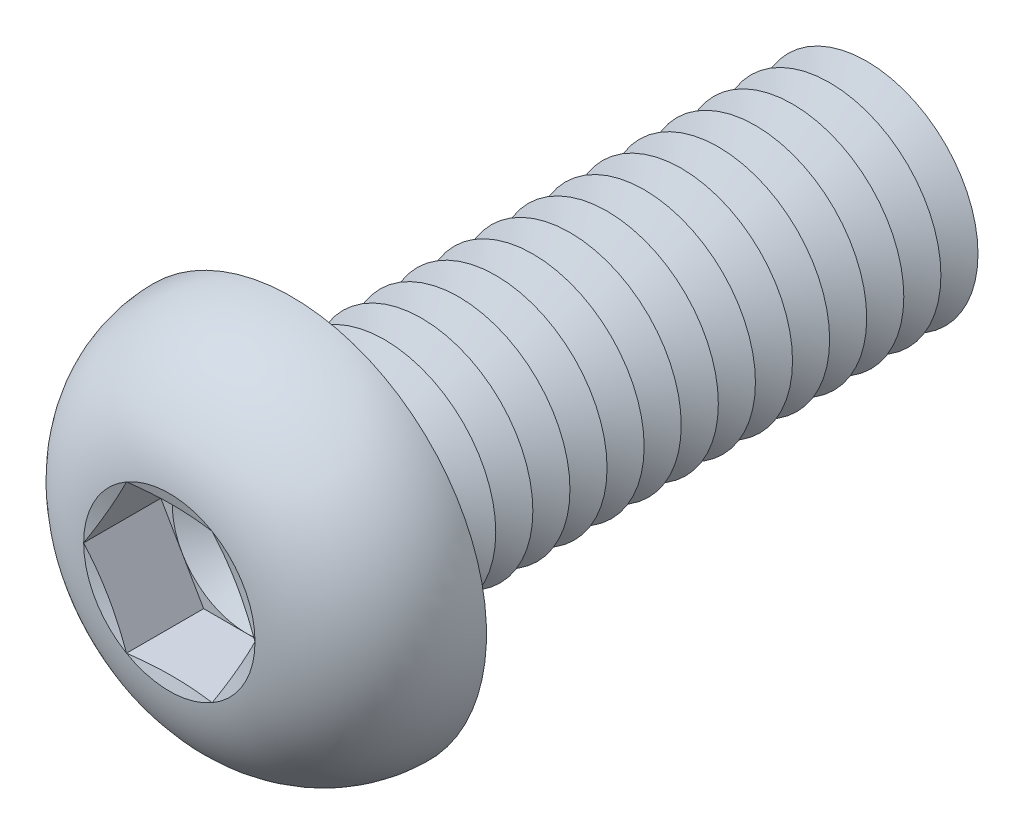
ISO-10303-21;
HEADER;
FILE_DESCRIPTION(('STEP AP214'),'2;1');
FILE_NAME('part.step','',(''),(''),'','','');
FILE_SCHEMA(('AUTOMOTIVE_DESIGN { 1 0 10303 214 1 1 1 1 }'));
ENDSEC;
DATA;
#1=APPLICATION_CONTEXT('core data for automotive mechanical design processes');
#2=APPLICATION_PROTOCOL_DEFINITION('international standard','automotive_design',2000,#1);
#3=PRODUCT_CONTEXT('',#1,'mechanical');
#4=PRODUCT('Part','Part','',(#3));
#5=PRODUCT_RELATED_PRODUCT_CATEGORY('part','',(#4));
#6=PRODUCT_DEFINITION_FORMATION('','',#4);
#7=PRODUCT_DEFINITION_CONTEXT('part definition',#1,'design');
#8=PRODUCT_DEFINITION('design','',#6,#7);
#9=PRODUCT_DEFINITION_SHAPE('','',#8);
#10=(LENGTH_UNIT() NAMED_UNIT(*) SI_UNIT(.MILLI.,.METRE.));
#11=(NAMED_UNIT(*) PLANE_ANGLE_UNIT() SI_UNIT($,.RADIAN.));
#12=(NAMED_UNIT(*) SI_UNIT($,.STERADIAN.) SOLID_ANGLE_UNIT());
#13=UNCERTAINTY_MEASURE_WITH_UNIT(LENGTH_MEASURE(1.E-05),#10,'distance_accuracy_value','');
#14=(GEOMETRIC_REPRESENTATION_CONTEXT(3) GLOBAL_UNCERTAINTY_ASSIGNED_CONTEXT((#13)) GLOBAL_UNIT_ASSIGNED_CONTEXT((#10,
#11,#12)) REPRESENTATION_CONTEXT('',''));
#15=CARTESIAN_POINT('',(0.,0.,0.));
#16=DIRECTION('',(0.,0.,1.));
#17=DIRECTION('',(1.,0.,0.));
#18=AXIS2_PLACEMENT_3D('',#15,#16,#17);
#19=CARTESIAN_POINT('',(0.,0.,1.22));
#20=DIRECTION('',(0.,0.,1.));
#21=DIRECTION('',(1.,0.,0.));
#22=AXIS2_PLACEMENT_3D('',#19,#20,#21);
#23=PLANE('',#22);
#24=CARTESIAN_POINT('',(0.,0.,1.22));
#25=DIRECTION('',(0.,0.,1.));
#26=DIRECTION('',(1.,0.,0.));
#27=AXIS2_PLACEMENT_3D('',#24,#25,#26);
#28=CIRCLE('',#27,1.99999906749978);
#29=CARTESIAN_POINT('',(1.73205,0.999999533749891,1.22));
#30=VERTEX_POINT('',#29);
#31=CARTESIAN_POINT('',(0.,1.99999906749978,1.22));
#32=VERTEX_POINT('',#31);
#33=EDGE_CURVE('E118',#30,#32,#28,.T.);
#34=ORIENTED_EDGE('',*,*,#33,.F.);
#35=DIRECTION('',(-0.5,0.866025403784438,0.));
#36=VECTOR('',#35,1.);
#37=CARTESIAN_POINT('',(2.3094,0.,1.22));
#38=LINE('',#37,#36);
#39=CARTESIAN_POINT('',(1.1547,1.99999906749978,1.22));
#40=VERTEX_POINT('',#39);
#41=EDGE_CURVE('E125',#30,#40,#38,.T.);
#42=ORIENTED_EDGE('',*,*,#41,.T.);
#43=DIRECTION('',(-1.,0.,0.));
#44=VECTOR('',#43,1.);
#45=CARTESIAN_POINT('',(1.1547,1.99999906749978,1.22));
#46=LINE('',#45,#44);
#47=EDGE_CURVE('E136',#40,#32,#46,.T.);
#48=ORIENTED_EDGE('',*,*,#47,.T.);
#49=EDGE_LOOP('',(#34,#42,#48));
#50=FACE_BOUND('',#49,.T.);
#51=ADVANCED_FACE('F39',(#50),#23,.T.);
#52=CARTESIAN_POINT('',(0.,0.,1.22));
#53=DIRECTION('',(0.,0.,1.));
#54=DIRECTION('',(1.,0.,0.));
#55=AXIS2_PLACEMENT_3D('',#52,#53,#54);
#56=CIRCLE('',#55,1.99999906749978);
#57=CARTESIAN_POINT('',(-1.73205,0.999999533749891,1.22));
#58=VERTEX_POINT('',#57);
#59=EDGE_CURVE('E11',#32,#58,#56,.T.);
#60=ORIENTED_EDGE('',*,*,#59,.F.);
#61=CARTESIAN_POINT('',(-1.1547,1.99999906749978,1.22));
#62=VERTEX_POINT('',#61);
#63=EDGE_CURVE('E131',#32,#62,#46,.T.);
#64=ORIENTED_EDGE('',*,*,#63,.T.);
#65=DIRECTION('',(-0.5,-0.866025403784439,0.));
#66=VECTOR('',#65,1.);
#67=CARTESIAN_POINT('',(-1.1547,1.99999906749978,1.22));
#68=LINE('',#67,#66);
#69=EDGE_CURVE('E134',#62,#58,#68,.T.);
#70=ORIENTED_EDGE('',*,*,#69,.T.);
#71=EDGE_LOOP('',(#60,#64,#70));
#72=FACE_BOUND('',#71,.T.);
#73=ADVANCED_FACE('F130',(#72),#23,.T.);
#74=CARTESIAN_POINT('',(-1.73205,-0.999999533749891,1.22));
#75=VERTEX_POINT('',#74);
#76=EDGE_CURVE('E49',#58,#75,#56,.T.);
#77=ORIENTED_EDGE('',*,*,#76,.F.);
#78=CARTESIAN_POINT('',(-2.3094,0.,1.22));
#79=VERTEX_POINT('',#78);
#80=EDGE_CURVE('E143',#58,#79,#68,.T.);
#81=ORIENTED_EDGE('',*,*,#80,.T.);
#82=DIRECTION('',(0.5,-0.866025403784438,0.));
#83=VECTOR('',#82,1.);
#84=CARTESIAN_POINT('',(-2.3094,0.,1.22));
#85=LINE('',#84,#83);
#86=EDGE_CURVE('E152',#79,#75,#85,.T.);
#87=ORIENTED_EDGE('',*,*,#86,.T.);
#88=EDGE_LOOP('',(#77,#81,#87));
#89=FACE_BOUND('',#88,.T.);
#90=ADVANCED_FACE('F394',(#89),#23,.T.);
#91=CARTESIAN_POINT('',(0.,-1.99999906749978,1.22));
#92=VERTEX_POINT('',#91);
#93=EDGE_CURVE('E378',#75,#92,#56,.T.);
#94=ORIENTED_EDGE('',*,*,#93,.F.);
#95=CARTESIAN_POINT('',(-1.1547,-1.99999906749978,1.22));
#96=VERTEX_POINT('',#95);
#97=EDGE_CURVE('E151',#75,#96,#85,.T.);
#98=ORIENTED_EDGE('',*,*,#97,.T.);
#99=DIRECTION('',(1.,0.,0.));
#100=VECTOR('',#99,1.);
#101=CARTESIAN_POINT('',(-1.1547,-1.99999906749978,1.22));
#102=LINE('',#101,#100);
#103=EDGE_CURVE('E157',#96,#92,#102,.T.);
#104=ORIENTED_EDGE('',*,*,#103,.T.);
#105=EDGE_LOOP('',(#94,#98,#104));
#106=FACE_BOUND('',#105,.T.);
#107=ADVANCED_FACE('F387',(#106),#23,.T.);
#108=CARTESIAN_POINT('',(1.73205,-0.999999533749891,1.22));
#109=VERTEX_POINT('',#108);
#110=EDGE_CURVE('E56',#92,#109,#56,.T.);
#111=ORIENTED_EDGE('',*,*,#110,.F.);
#112=CARTESIAN_POINT('',(1.1547,-1.99999906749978,1.22));
#113=VERTEX_POINT('',#112);
#114=EDGE_CURVE('E156',#92,#113,#102,.T.);
#115=ORIENTED_EDGE('',*,*,#114,.T.);
#116=DIRECTION('',(0.5,0.866025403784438,0.));
#117=VECTOR('',#116,1.);
#118=CARTESIAN_POINT('',(1.1547,-1.99999906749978,1.22));
#119=LINE('',#118,#117);
#120=EDGE_CURVE('E162',#113,#109,#119,.T.);
#121=ORIENTED_EDGE('',*,*,#120,.T.);
#122=EDGE_LOOP('',(#111,#115,#121));
#123=FACE_BOUND('',#122,.T.);
#124=ADVANCED_FACE('F465',(#123),#23,.T.);
#125=CARTESIAN_POINT('',(0.,0.,3.3));
#126=DIRECTION('',(0.,0.,1.));
#127=DIRECTION('',(1.,0.,0.));
#128=AXIS2_PLACEMENT_3D('',#125,#126,#127);
#129=CONICAL_SURFACE('',#128,2.3094,1.30899693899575);
#130=CARTESIAN_POINT('',(2.30951547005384,-0.000199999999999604,3.30003094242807));
#131=CARTESIAN_POINT('',(2.26155412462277,0.0828714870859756,3.2871729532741));
#132=CARTESIAN_POINT('',(2.21350580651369,0.16609361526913,3.27549992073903));
#133=CARTESIAN_POINT('',(2.11723944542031,0.332831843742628,3.2549913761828));
#134=CARTESIAN_POINT('',(2.06902134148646,0.416348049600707,3.24615701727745));
#135=CARTESIAN_POINT('',(1.97270782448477,0.583167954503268,3.23184167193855));
#136=CARTESIAN_POINT('',(1.92461306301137,0.666470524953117,3.22634360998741));
#137=CARTESIAN_POINT('',(1.82836219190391,0.83318192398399,3.21897125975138));
#138=CARTESIAN_POINT('',(1.78020609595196,0.91659072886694,3.21709626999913));
#139=CARTESIAN_POINT('',(1.68389390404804,1.08340833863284,3.21709626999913));
#140=CARTESIAN_POINT('',(1.63573780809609,1.16681714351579,3.21897125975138));
#141=CARTESIAN_POINT('',(1.53948693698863,1.33352854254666,3.22634360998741));
#142=CARTESIAN_POINT('',(1.49139217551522,1.41683111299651,3.23184167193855));
#143=CARTESIAN_POINT('',(1.39507865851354,1.58365101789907,3.24615701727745));
#144=CARTESIAN_POINT('',(1.34686055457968,1.66716722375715,3.2549913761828));
#145=CARTESIAN_POINT('',(1.25059419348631,1.83390545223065,3.27549992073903));
#146=CARTESIAN_POINT('',(1.20254587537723,1.91712758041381,3.2871729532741));
#147=CARTESIAN_POINT('',(1.15458452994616,2.00019906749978,3.30003094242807));
#148=B_SPLINE_CURVE_WITH_KNOTS('',3,(#130,#131,#132,#133,#134,#135,#136,#137,#138,#139,#140,
#141,#142,#143,#144,#145,#146,#147),.UNSPECIFIED.,.F.,.F.,(4,2,2,2,2,2,2,2,4),(0.,
0.290357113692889,0.580832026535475,0.869807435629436,1.15872689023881,1.44764634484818,
1.73662175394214,2.02709666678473,2.31745378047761),.UNSPECIFIED.);
#149=CARTESIAN_POINT('',(2.3094,0.,3.3));
#150=VERTEX_POINT('',#149);
#151=CARTESIAN_POINT('',(1.15469999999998,1.99999906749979,3.3));
#152=VERTEX_POINT('',#151);
#153=EDGE_CURVE('E221',#150,#152,#148,.T.);
#154=ORIENTED_EDGE('',*,*,#153,.F.);
#155=CARTESIAN_POINT('',(0.,0.,3.3));
#156=DIRECTION('',(0.,0.,-1.));
#157=DIRECTION('',(-1.,0.,0.));
#158=AXIS2_PLACEMENT_3D('',#155,#156,#157);
#159=CIRCLE('',#158,2.3094);
#160=EDGE_CURVE('E425',#152,#150,#159,.T.);
#161=ORIENTED_EDGE('',*,*,#160,.F.);
#162=EDGE_LOOP('',(#154,#161));
#163=FACE_BOUND('',#162,.T.);
#164=ADVANCED_FACE('F469',(#163),#129,.F.);
#165=CARTESIAN_POINT('',(1.15458452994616,-2.00019906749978,3.30003094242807));
#166=CARTESIAN_POINT('',(1.20254587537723,-1.91712758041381,3.2871729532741));
#167=CARTESIAN_POINT('',(1.25059419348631,-1.83390545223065,3.27549992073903));
#168=CARTESIAN_POINT('',(1.34686055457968,-1.66716722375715,3.2549913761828));
#169=CARTESIAN_POINT('',(1.39507865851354,-1.58365101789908,3.24615701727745));
#170=CARTESIAN_POINT('',(1.49139217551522,-1.41683111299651,3.23184167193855));
#171=CARTESIAN_POINT('',(1.53948693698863,-1.33352854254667,3.22634360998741));
#172=CARTESIAN_POINT('',(1.63573780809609,-1.16681714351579,3.21897125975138));
#173=CARTESIAN_POINT('',(1.68389390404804,-1.08340833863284,3.21709626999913));
#174=CARTESIAN_POINT('',(1.78020609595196,-0.916590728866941,3.21709626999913));
#175=CARTESIAN_POINT('',(1.82836219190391,-0.833181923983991,3.21897125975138));
#176=CARTESIAN_POINT('',(1.92461306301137,-0.666470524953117,3.22634360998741));
#177=CARTESIAN_POINT('',(1.97270782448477,-0.583167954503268,3.23184167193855));
#178=CARTESIAN_POINT('',(2.06902134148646,-0.416348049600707,3.24615701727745));
#179=CARTESIAN_POINT('',(2.11723944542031,-0.332831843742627,3.2549913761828));
#180=CARTESIAN_POINT('',(2.21350580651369,-0.166093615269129,3.27549992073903));
#181=CARTESIAN_POINT('',(2.26155412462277,-0.0828714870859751,3.2871729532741));
#182=CARTESIAN_POINT('',(2.30951547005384,0.000200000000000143,3.30003094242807));
#183=B_SPLINE_CURVE_WITH_KNOTS('',3,(#165,#166,#167,#168,#169,#170,#171,#172,#173,#174,#175,
#176,#177,#178,#179,#180,#181,#182),.UNSPECIFIED.,.F.,.F.,(4,2,2,2,2,2,2,2,4),(0.,
0.290357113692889,0.580832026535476,0.869807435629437,1.15872689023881,1.44764634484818,
1.73662175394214,2.02709666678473,2.31745378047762),.UNSPECIFIED.);
#184=CARTESIAN_POINT('',(1.1547,-1.99999906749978,3.3));
#185=VERTEX_POINT('',#184);
#186=EDGE_CURVE('E230',#185,#150,#183,.T.);
#187=ORIENTED_EDGE('',*,*,#186,.F.);
#188=EDGE_CURVE('E427',#150,#185,#159,.T.);
#189=ORIENTED_EDGE('',*,*,#188,.F.);
#190=EDGE_LOOP('',(#187,#189));
#191=FACE_BOUND('',#190,.T.);
#192=ADVANCED_FACE('F475',(#191),#129,.F.);
#193=CARTESIAN_POINT('',(-3.4849337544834,-1.99999906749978,3.75783251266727));
#194=CARTESIAN_POINT('',(-3.40057136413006,-1.99999906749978,3.73822859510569));
#195=CARTESIAN_POINT('',(-3.31617090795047,-1.99999906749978,3.71878852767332));
#196=CARTESIAN_POINT('',(-3.14727791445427,-1.99999906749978,3.68030638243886));
#197=CARTESIAN_POINT('',(-3.06278537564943,-1.99999906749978,3.66126431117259));
#198=CARTESIAN_POINT('',(-2.80911712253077,-1.99999906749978,3.60483420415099));
#199=CARTESIAN_POINT('',(-2.63978343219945,-1.99999906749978,3.5681499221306));
#200=CARTESIAN_POINT('',(-2.29895421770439,-1.99999906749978,3.49717072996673));
#201=CARTESIAN_POINT('',(-2.12745330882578,-1.99999906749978,3.4629014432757));
#202=CARTESIAN_POINT('',(-1.78364663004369,-1.99999906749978,3.39849485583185));
#203=CARTESIAN_POINT('',(-1.61134079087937,-1.99999906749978,3.36835791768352));
#204=CARTESIAN_POINT('',(-1.27040784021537,-1.99999906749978,3.31501553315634));
#205=CARTESIAN_POINT('',(-1.10180724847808,-1.99999906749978,3.291644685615));
#206=CARTESIAN_POINT('',(-0.763641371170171,-1.99999906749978,3.2533727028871));
#207=CARTESIAN_POINT('',(-0.594076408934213,-1.99999906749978,3.23846888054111));
#208=CARTESIAN_POINT('',(-0.339649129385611,-1.99999906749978,3.22431372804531));
#209=CARTESIAN_POINT('',(-0.255009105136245,-1.99999906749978,3.22096057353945));
#210=CARTESIAN_POINT('',(-0.0856618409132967,-1.99999906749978,3.21711210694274));
#211=CARTESIAN_POINT('',(-0.000954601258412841,-1.99999906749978,3.2166167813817));
#212=CARTESIAN_POINT('',(0.168430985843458,-1.99999906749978,3.21851478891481));
#213=CARTESIAN_POINT('',(0.25310933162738,-1.99999906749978,3.2209082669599));
#214=CARTESIAN_POINT('',(0.422344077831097,-1.99999906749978,3.22845792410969));
#215=CARTESIAN_POINT('',(0.506900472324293,-1.99999906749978,3.23361423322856));
#216=CARTESIAN_POINT('',(0.712240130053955,-1.99999906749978,3.24921577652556));
#217=CARTESIAN_POINT('',(0.832922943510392,-1.99999906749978,3.26098285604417));
#218=CARTESIAN_POINT('',(1.07378161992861,-1.99999906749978,3.28874908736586));
#219=CARTESIAN_POINT('',(1.1939575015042,-1.99999906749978,3.30474808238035));
#220=CARTESIAN_POINT('',(1.43419655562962,-1.99999906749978,3.34009172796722));
#221=CARTESIAN_POINT('',(1.55425817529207,-1.99999906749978,3.35944677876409));
#222=CARTESIAN_POINT('',(1.79394991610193,-1.99999906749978,3.40067076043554));
#223=CARTESIAN_POINT('',(1.91358001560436,-1.99999906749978,3.42253981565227));
#224=CARTESIAN_POINT('',(2.15493405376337,-1.99999906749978,3.46864194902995));
#225=CARTESIAN_POINT('',(2.27665041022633,-1.99999906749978,3.49291441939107));
#226=CARTESIAN_POINT('',(2.51977680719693,-1.99999906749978,3.54294628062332));
#227=CARTESIAN_POINT('',(2.64118684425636,-1.99999906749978,3.56870568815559));
#228=CARTESIAN_POINT('',(2.88310060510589,-1.99999906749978,3.62120891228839));
#229=CARTESIAN_POINT('',(3.00360566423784,-1.99999906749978,3.6479466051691));
#230=CARTESIAN_POINT('',(3.24441021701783,-1.99999906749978,3.7022947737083));
#231=CARTESIAN_POINT('',(3.36470972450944,-1.99999906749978,3.72990518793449));
#232=CARTESIAN_POINT('',(3.4849337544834,-1.99999906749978,3.75783251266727));
#233=B_SPLINE_CURVE_WITH_KNOTS('',3,(#193,#194,#195,#196,#197,#198,#199,#200,#201,#202,#203,
#204,#205,#206,#207,#208,#209,#210,#211,#212,#213,#214,#215,#216,#217,#218,#219,#220,#221,#222,
#223,#224,#225,#226,#227,#228,#229,#230,#231,#232),.UNSPECIFIED.,.F.,.F.,(4,2,2,2,2,2,2,2,2,2,2,
2,2,2,2,2,2,2,2,4),(0.,0.259830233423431,0.519664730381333,1.03943435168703,1.56407662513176,
2.08876490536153,2.59926476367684,3.10960251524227,3.36367930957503,3.61775490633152,
3.87184325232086,4.1259435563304,4.48960924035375,4.85326145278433,5.21806142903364,
5.58287945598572,5.95520617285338,6.32753706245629,6.69784064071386,7.06811821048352),.UNSPECIFIED.);
#234=CARTESIAN_POINT('',(-1.1547,-1.99999906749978,3.3));
#235=VERTEX_POINT('',#234);
#236=EDGE_CURVE('E406',#235,#185,#233,.T.);
#237=ORIENTED_EDGE('',*,*,#236,.F.);
#238=EDGE_CURVE('E414',#185,#235,#159,.T.);
#239=ORIENTED_EDGE('',*,*,#238,.F.);
#240=EDGE_LOOP('',(#237,#239));
#241=FACE_BOUND('',#240,.T.);
#242=ADVANCED_FACE('F487',(#241),#129,.F.);
#243=CARTESIAN_POINT('',(-2.30951547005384,0.000200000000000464,3.30003094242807));
#244=CARTESIAN_POINT('',(-2.26155412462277,-0.0828714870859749,3.2871729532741));
#245=CARTESIAN_POINT('',(-2.21350580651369,-0.166093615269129,3.27549992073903));
#246=CARTESIAN_POINT('',(-2.11723944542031,-0.332831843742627,3.2549913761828));
#247=CARTESIAN_POINT('',(-2.06902134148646,-0.416348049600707,3.24615701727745));
#248=CARTESIAN_POINT('',(-1.97270782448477,-0.583167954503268,3.23184167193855));
#249=CARTESIAN_POINT('',(-1.92461306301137,-0.666470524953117,3.22634360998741));
#250=CARTESIAN_POINT('',(-1.82836219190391,-0.833181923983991,3.21897125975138));
#251=CARTESIAN_POINT('',(-1.78020609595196,-0.916590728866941,3.21709626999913));
#252=CARTESIAN_POINT('',(-1.68389390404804,-1.08340833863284,3.21709626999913));
#253=CARTESIAN_POINT('',(-1.63573780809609,-1.16681714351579,3.21897125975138));
#254=CARTESIAN_POINT('',(-1.53948693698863,-1.33352854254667,3.22634360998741));
#255=CARTESIAN_POINT('',(-1.49139217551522,-1.41683111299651,3.23184167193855));
#256=CARTESIAN_POINT('',(-1.39507865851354,-1.58365101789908,3.24615701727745));
#257=CARTESIAN_POINT('',(-1.34686055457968,-1.66716722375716,3.2549913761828));
#258=CARTESIAN_POINT('',(-1.25059419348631,-1.83390545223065,3.27549992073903));
#259=CARTESIAN_POINT('',(-1.20254587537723,-1.91712758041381,3.2871729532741));
#260=CARTESIAN_POINT('',(-1.15458452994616,-2.00019906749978,3.30003094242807));
#261=B_SPLINE_CURVE_WITH_KNOTS('',3,(#243,#244,#245,#246,#247,#248,#249,#250,#251,#252,#253,
#254,#255,#256,#257,#258,#259,#260),.UNSPECIFIED.,.F.,.F.,(4,2,2,2,2,2,2,2,4),(0.,
0.290357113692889,0.580832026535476,0.869807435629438,1.15872689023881,1.44764634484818,
1.73662175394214,2.02709666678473,2.31745378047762),.UNSPECIFIED.);
#262=CARTESIAN_POINT('',(-2.3094,0.,3.3));
#263=VERTEX_POINT('',#262);
#264=EDGE_CURVE('E399',#263,#235,#261,.T.);
#265=ORIENTED_EDGE('',*,*,#264,.F.);
#266=EDGE_CURVE('E362',#235,#263,#159,.T.);
#267=ORIENTED_EDGE('',*,*,#266,.F.);
#268=EDGE_LOOP('',(#265,#267));
#269=FACE_BOUND('',#268,.T.);
#270=ADVANCED_FACE('F403',(#269),#129,.F.);
#271=CARTESIAN_POINT('',(-1.15458452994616,2.00019906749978,3.30003094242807));
#272=CARTESIAN_POINT('',(-1.20254587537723,1.91712758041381,3.2871729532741));
#273=CARTESIAN_POINT('',(-1.25059419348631,1.83390545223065,3.27549992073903));
#274=CARTESIAN_POINT('',(-1.34686055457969,1.66716722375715,3.2549913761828));
#275=CARTESIAN_POINT('',(-1.39507865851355,1.58365101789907,3.24615701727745));
#276=CARTESIAN_POINT('',(-1.49139217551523,1.41683111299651,3.23184167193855));
#277=CARTESIAN_POINT('',(-1.53948693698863,1.33352854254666,3.22634360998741));
#278=CARTESIAN_POINT('',(-1.63573780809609,1.16681714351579,3.21897125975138));
#279=CARTESIAN_POINT('',(-1.68389390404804,1.08340833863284,3.21709626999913));
#280=CARTESIAN_POINT('',(-1.78020609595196,0.91659072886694,3.21709626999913));
#281=CARTESIAN_POINT('',(-1.82836219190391,0.83318192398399,3.21897125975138));
#282=CARTESIAN_POINT('',(-1.92461306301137,0.666470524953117,3.22634360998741));
#283=CARTESIAN_POINT('',(-1.97270782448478,0.583167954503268,3.23184167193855));
#284=CARTESIAN_POINT('',(-2.06902134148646,0.416348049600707,3.24615701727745));
#285=CARTESIAN_POINT('',(-2.11723944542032,0.332831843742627,3.2549913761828));
#286=CARTESIAN_POINT('',(-2.21350580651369,0.166093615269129,3.27549992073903));
#287=CARTESIAN_POINT('',(-2.26155412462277,0.0828714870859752,3.2871729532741));
#288=CARTESIAN_POINT('',(-2.30951547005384,-0.000200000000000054,3.30003094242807));
#289=B_SPLINE_CURVE_WITH_KNOTS('',3,(#271,#272,#273,#274,#275,#276,#277,#278,#279,#280,#281,
#282,#283,#284,#285,#286,#287,#288),.UNSPECIFIED.,.F.,.F.,(4,2,2,2,2,2,2,2,4),(0.,
0.290357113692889,0.580832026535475,0.869807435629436,1.15872689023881,1.44764634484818,
1.73662175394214,2.02709666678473,2.31745378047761),.UNSPECIFIED.);
#290=CARTESIAN_POINT('',(-1.1547,1.99999906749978,3.3));
#291=VERTEX_POINT('',#290);
#292=EDGE_CURVE('E195',#291,#263,#289,.T.);
#293=ORIENTED_EDGE('',*,*,#292,.F.);
#294=EDGE_CURVE('E363',#263,#291,#159,.T.);
#295=ORIENTED_EDGE('',*,*,#294,.F.);
#296=EDGE_LOOP('',(#293,#295));
#297=FACE_BOUND('',#296,.T.);
#298=ADVANCED_FACE('F417',(#297),#129,.F.);
#299=CARTESIAN_POINT('',(0.,0.,-12.5));
#300=DIRECTION('',(0.,0.,1.));
#301=DIRECTION('',(1.,0.,0.));
#302=AXIS2_PLACEMENT_3D('',#299,#300,#301);
#303=CONICAL_SURFACE('',#302,3.,1.0471975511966);
#304=CARTESIAN_POINT('',(0.,0.,-13.));
#305=DIRECTION('',(0.,0.,1.));
#306=DIRECTION('',(1.,0.,0.));
#307=AXIS2_PLACEMENT_3D('',#304,#305,#306);
#308=CIRCLE('',#307,2.13397459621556);
#309=CARTESIAN_POINT('',(2.13397459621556,0.,-13.));
#310=VERTEX_POINT('',#309);
#311=EDGE_CURVE('E334',#310,#310,#308,.T.);
#312=ORIENTED_EDGE('',*,*,#311,.T.);
#313=EDGE_LOOP('',(#312));
#314=FACE_BOUND('',#313,.T.);
#315=CARTESIAN_POINT('',(0.,0.,-12.5));
#316=DIRECTION('',(0.,0.,1.));
#317=DIRECTION('',(1.,0.,0.));
#318=AXIS2_PLACEMENT_3D('',#315,#316,#317);
#319=CIRCLE('',#318,3.);
#320=CARTESIAN_POINT('',(3.,0.,-12.5));
#321=VERTEX_POINT('',#320);
#322=EDGE_CURVE('E330',#321,#321,#319,.T.);
#323=ORIENTED_EDGE('',*,*,#322,.F.);
#324=EDGE_LOOP('',(#323));
#325=FACE_BOUND('',#324,.T.);
#326=ADVANCED_FACE('F553',(#314,#325),#303,.T.);
#327=CARTESIAN_POINT('',(0.,0.,-13.));
#328=DIRECTION('',(0.,0.,-1.));
#329=DIRECTION('',(-1.,0.,0.));
#330=AXIS2_PLACEMENT_3D('',#327,#328,#329);
#331=CONICAL_SURFACE('',#330,2.13397459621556,1.0471975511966);
#332=CARTESIAN_POINT('',(0.,0.,-13.5));
#333=DIRECTION('',(0.,0.,1.));
#334=DIRECTION('',(1.,0.,0.));
#335=AXIS2_PLACEMENT_3D('',#332,#333,#334);
#336=CIRCLE('',#335,3.);
#337=CARTESIAN_POINT('',(3.,0.,-13.5));
#338=VERTEX_POINT('',#337);
#339=EDGE_CURVE('E338',#338,#338,#336,.T.);
#340=ORIENTED_EDGE('',*,*,#339,.T.);
#341=EDGE_LOOP('',(#340));
#342=FACE_BOUND('',#341,.T.);
#343=ORIENTED_EDGE('',*,*,#311,.F.);
#344=EDGE_LOOP('',(#343));
#345=FACE_BOUND('',#344,.T.);
#346=ADVANCED_FACE('F848',(#342,#345),#331,.T.);
#347=CARTESIAN_POINT('',(0.,3.00000000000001,-16.));
#348=DIRECTION('',(0.,0.,-1.));
#349=DIRECTION('',(-1.,0.,0.));
#350=AXIS2_PLACEMENT_3D('',#347,#348,#349);
#351=PLANE('',#350);
#352=CARTESIAN_POINT('',(0.,0.,-16.));
#353=DIRECTION('',(0.,0.,1.));
#354=DIRECTION('',(1.,0.,0.));
#355=AXIS2_PLACEMENT_3D('',#352,#353,#354);
#356=CIRCLE('',#355,2.13397459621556);
#357=CARTESIAN_POINT('',(2.13397459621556,0.,-16.));
#358=VERTEX_POINT('',#357);
#359=EDGE_CURVE('E358',#358,#358,#356,.T.);
#360=ORIENTED_EDGE('',*,*,#359,.F.);
#361=EDGE_LOOP('',(#360));
#362=FACE_BOUND('',#361,.T.);
#363=ADVANCED_FACE('F842',(#362),#351,.T.);
#364=CARTESIAN_POINT('',(0.,0.,-15.5));
#365=DIRECTION('',(0.,0.,1.));
#366=DIRECTION('',(1.,0.,0.));
#367=AXIS2_PLACEMENT_3D('',#364,#365,#366);
#368=CONICAL_SURFACE('',#367,3.,1.0471975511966);
#369=ORIENTED_EDGE('',*,*,#359,.T.);
#370=EDGE_LOOP('',(#369));
#371=FACE_BOUND('',#370,.T.);
#372=CARTESIAN_POINT('',(0.,0.,-15.5));
#373=DIRECTION('',(0.,0.,1.));
#374=DIRECTION('',(1.,0.,0.));
#375=AXIS2_PLACEMENT_3D('',#372,#373,#374);
#376=CIRCLE('',#375,3.);
#377=CARTESIAN_POINT('',(3.,0.,-15.5));
#378=VERTEX_POINT('',#377);
#379=EDGE_CURVE('E354',#378,#378,#376,.T.);
#380=ORIENTED_EDGE('',*,*,#379,.F.);
#381=EDGE_LOOP('',(#380));
#382=FACE_BOUND('',#381,.T.);
#383=ADVANCED_FACE('F835',(#371,#382),#368,.T.);
#384=CARTESIAN_POINT('',(0.,0.,-15.));
#385=DIRECTION('',(0.,0.,-1.));
#386=DIRECTION('',(-1.,0.,0.));
#387=AXIS2_PLACEMENT_3D('',#384,#385,#386);
#388=CONICAL_SURFACE('',#387,2.13397459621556,1.0471975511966);
#389=ORIENTED_EDGE('',*,*,#379,.T.);
#390=EDGE_LOOP('',(#389));
#391=FACE_BOUND('',#390,.T.);
#392=CARTESIAN_POINT('',(0.,0.,-15.));
#393=DIRECTION('',(0.,0.,1.));
#394=DIRECTION('',(1.,0.,0.));
#395=AXIS2_PLACEMENT_3D('',#392,#393,#394);
#396=CIRCLE('',#395,2.13397459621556);
#397=CARTESIAN_POINT('',(2.13397459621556,0.,-15.));
#398=VERTEX_POINT('',#397);
#399=EDGE_CURVE('E350',#398,#398,#396,.T.);
#400=ORIENTED_EDGE('',*,*,#399,.F.);
#401=EDGE_LOOP('',(#400));
#402=FACE_BOUND('',#401,.T.);
#403=ADVANCED_FACE('F828',(#391,#402),#388,.T.);
#404=CARTESIAN_POINT('',(0.,0.,-14.5));
#405=DIRECTION('',(0.,0.,1.));
#406=DIRECTION('',(1.,0.,0.));
#407=AXIS2_PLACEMENT_3D('',#404,#405,#406);
#408=CONICAL_SURFACE('',#407,3.,1.0471975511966);
#409=ORIENTED_EDGE('',*,*,#399,.T.);
#410=EDGE_LOOP('',(#409));
#411=FACE_BOUND('',#410,.T.);
#412=CARTESIAN_POINT('',(0.,0.,-14.5));
#413=DIRECTION('',(0.,0.,1.));
#414=DIRECTION('',(1.,0.,0.));
#415=AXIS2_PLACEMENT_3D('',#412,#413,#414);
#416=CIRCLE('',#415,3.);
#417=CARTESIAN_POINT('',(3.,0.,-14.5));
#418=VERTEX_POINT('',#417);
#419=EDGE_CURVE('E346',#418,#418,#416,.T.);
#420=ORIENTED_EDGE('',*,*,#419,.F.);
#421=EDGE_LOOP('',(#420));
#422=FACE_BOUND('',#421,.T.);
#423=ADVANCED_FACE('F821',(#411,#422),#408,.T.);
#424=CARTESIAN_POINT('',(0.,0.,-14.));
#425=DIRECTION('',(0.,0.,-1.));
#426=DIRECTION('',(-1.,0.,0.));
#427=AXIS2_PLACEMENT_3D('',#424,#425,#426);
#428=CONICAL_SURFACE('',#427,2.13397459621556,1.0471975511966);
#429=ORIENTED_EDGE('',*,*,#419,.T.);
#430=EDGE_LOOP('',(#429));
#431=FACE_BOUND('',#430,.T.);
#432=CARTESIAN_POINT('',(0.,0.,-14.));
#433=DIRECTION('',(0.,0.,1.));
#434=DIRECTION('',(1.,0.,0.));
#435=AXIS2_PLACEMENT_3D('',#432,#433,#434);
#436=CIRCLE('',#435,2.13397459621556);
#437=CARTESIAN_POINT('',(2.13397459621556,0.,-14.));
#438=VERTEX_POINT('',#437);
#439=EDGE_CURVE('E342',#438,#438,#436,.T.);
#440=ORIENTED_EDGE('',*,*,#439,.F.);
#441=EDGE_LOOP('',(#440));
#442=FACE_BOUND('',#441,.T.);
#443=ADVANCED_FACE('F814',(#431,#442),#428,.T.);
#444=CARTESIAN_POINT('',(0.,0.,-13.5));
#445=DIRECTION('',(0.,0.,1.));
#446=DIRECTION('',(1.,0.,0.));
#447=AXIS2_PLACEMENT_3D('',#444,#445,#446);
#448=CONICAL_SURFACE('',#447,3.,1.0471975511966);
#449=ORIENTED_EDGE('',*,*,#439,.T.);
#450=EDGE_LOOP('',(#449));
#451=FACE_BOUND('',#450,.T.);
#452=ORIENTED_EDGE('',*,*,#339,.F.);
#453=EDGE_LOOP('',(#452));
#454=FACE_BOUND('',#453,.T.);
#455=ADVANCED_FACE('F807',(#451,#454),#448,.T.);
#456=CARTESIAN_POINT('',(0.,0.,-11.5));
#457=DIRECTION('',(0.,0.,1.));
#458=DIRECTION('',(1.,0.,0.));
#459=AXIS2_PLACEMENT_3D('',#456,#457,#458);
#460=CONICAL_SURFACE('',#459,3.,1.0471975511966);
#461=CARTESIAN_POINT('',(0.,0.,-12.));
#462=DIRECTION('',(0.,0.,1.));
#463=DIRECTION('',(1.,0.,0.));
#464=AXIS2_PLACEMENT_3D('',#461,#462,#463);
#465=CIRCLE('',#464,2.13397459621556);
#466=CARTESIAN_POINT('',(2.13397459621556,0.,-12.));
#467=VERTEX_POINT('',#466);
#468=EDGE_CURVE('E327',#467,#467,#465,.T.);
#469=ORIENTED_EDGE('',*,*,#468,.T.);
#470=EDGE_LOOP('',(#469));
#471=FACE_BOUND('',#470,.T.);
#472=CARTESIAN_POINT('',(0.,0.,-11.5));
#473=DIRECTION('',(0.,0.,1.));
#474=DIRECTION('',(1.,0.,0.));
#475=AXIS2_PLACEMENT_3D('',#472,#473,#474);
#476=CIRCLE('',#475,3.);
#477=CARTESIAN_POINT('',(3.,0.,-11.5));
#478=VERTEX_POINT('',#477);
#479=EDGE_CURVE('E323',#478,#478,#476,.T.);
#480=ORIENTED_EDGE('',*,*,#479,.F.);
#481=EDGE_LOOP('',(#480));
#482=FACE_BOUND('',#481,.T.);
#483=ADVANCED_FACE('F800',(#471,#482),#460,.T.);
#484=CARTESIAN_POINT('',(0.,0.,-12.));
#485=DIRECTION('',(0.,0.,-1.));
#486=DIRECTION('',(-1.,0.,0.));
#487=AXIS2_PLACEMENT_3D('',#484,#485,#486);
#488=CONICAL_SURFACE('',#487,2.13397459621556,1.0471975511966);
#489=ORIENTED_EDGE('',*,*,#322,.T.);
#490=EDGE_LOOP('',(#489));
#491=FACE_BOUND('',#490,.T.);
#492=ORIENTED_EDGE('',*,*,#468,.F.);
#493=EDGE_LOOP('',(#492));
#494=FACE_BOUND('',#493,.T.);
#495=ADVANCED_FACE('F793',(#491,#494),#488,.T.);
#496=CARTESIAN_POINT('',(0.,0.,-10.5));
#497=DIRECTION('',(0.,0.,1.));
#498=DIRECTION('',(1.,0.,0.));
#499=AXIS2_PLACEMENT_3D('',#496,#497,#498);
#500=CONICAL_SURFACE('',#499,3.,1.0471975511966);
#501=CARTESIAN_POINT('',(0.,0.,-11.));
#502=DIRECTION('',(0.,0.,1.));
#503=DIRECTION('',(1.,0.,0.));
#504=AXIS2_PLACEMENT_3D('',#501,#502,#503);
#505=CIRCLE('',#504,2.13397459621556);
#506=CARTESIAN_POINT('',(2.13397459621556,0.,-11.));
#507=VERTEX_POINT('',#506);
#508=EDGE_CURVE('E319',#507,#507,#505,.T.);
#509=ORIENTED_EDGE('',*,*,#508,.T.);
#510=EDGE_LOOP('',(#509));
#511=FACE_BOUND('',#510,.T.);
#512=CARTESIAN_POINT('',(0.,0.,-10.5));
#513=DIRECTION('',(0.,0.,1.));
#514=DIRECTION('',(1.,0.,0.));
#515=AXIS2_PLACEMENT_3D('',#512,#513,#514);
#516=CIRCLE('',#515,3.);
#517=CARTESIAN_POINT('',(3.,0.,-10.5));
#518=VERTEX_POINT('',#517);
#519=EDGE_CURVE('E315',#518,#518,#516,.T.);
#520=ORIENTED_EDGE('',*,*,#519,.F.);
#521=EDGE_LOOP('',(#520));
#522=FACE_BOUND('',#521,.T.);
#523=ADVANCED_FACE('F786',(#511,#522),#500,.T.);
#524=CARTESIAN_POINT('',(0.,0.,-11.));
#525=DIRECTION('',(0.,0.,-1.));
#526=DIRECTION('',(-1.,0.,0.));
#527=AXIS2_PLACEMENT_3D('',#524,#525,#526);
#528=CONICAL_SURFACE('',#527,2.13397459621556,1.0471975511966);
#529=ORIENTED_EDGE('',*,*,#479,.T.);
#530=EDGE_LOOP('',(#529));
#531=FACE_BOUND('',#530,.T.);
#532=ORIENTED_EDGE('',*,*,#508,.F.);
#533=EDGE_LOOP('',(#532));
#534=FACE_BOUND('',#533,.T.);
#535=ADVANCED_FACE('F779',(#531,#534),#528,.T.);
#536=CARTESIAN_POINT('',(0.,0.,-9.5));
#537=DIRECTION('',(0.,0.,1.));
#538=DIRECTION('',(1.,0.,0.));
#539=AXIS2_PLACEMENT_3D('',#536,#537,#538);
#540=CONICAL_SURFACE('',#539,3.,1.0471975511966);
#541=CARTESIAN_POINT('',(0.,0.,-10.));
#542=DIRECTION('',(0.,0.,1.));
#543=DIRECTION('',(1.,0.,0.));
#544=AXIS2_PLACEMENT_3D('',#541,#542,#543);
#545=CIRCLE('',#544,2.13397459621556);
#546=CARTESIAN_POINT('',(2.13397459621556,0.,-10.));
#547=VERTEX_POINT('',#546);
#548=EDGE_CURVE('E311',#547,#547,#545,.T.);
#549=ORIENTED_EDGE('',*,*,#548,.T.);
#550=EDGE_LOOP('',(#549));
#551=FACE_BOUND('',#550,.T.);
#552=CARTESIAN_POINT('',(0.,0.,-9.5));
#553=DIRECTION('',(0.,0.,1.));
#554=DIRECTION('',(1.,0.,0.));
#555=AXIS2_PLACEMENT_3D('',#552,#553,#554);
#556=CIRCLE('',#555,3.);
#557=CARTESIAN_POINT('',(3.,0.,-9.5));
#558=VERTEX_POINT('',#557);
#559=EDGE_CURVE('E308',#558,#558,#556,.T.);
#560=ORIENTED_EDGE('',*,*,#559,.F.);
#561=EDGE_LOOP('',(#560));
#562=FACE_BOUND('',#561,.T.);
#563=ADVANCED_FACE('F772',(#551,#562),#540,.T.);
#564=CARTESIAN_POINT('',(0.,0.,-10.));
#565=DIRECTION('',(0.,0.,-1.));
#566=DIRECTION('',(-1.,0.,0.));
#567=AXIS2_PLACEMENT_3D('',#564,#565,#566);
#568=CONICAL_SURFACE('',#567,2.13397459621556,1.0471975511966);
#569=ORIENTED_EDGE('',*,*,#519,.T.);
#570=EDGE_LOOP('',(#569));
#571=FACE_BOUND('',#570,.T.);
#572=ORIENTED_EDGE('',*,*,#548,.F.);
#573=EDGE_LOOP('',(#572));
#574=FACE_BOUND('',#573,.T.);
#575=ADVANCED_FACE('F765',(#571,#574),#568,.T.);
#576=CARTESIAN_POINT('',(0.,0.,-8.5));
#577=DIRECTION('',(0.,0.,1.));
#578=DIRECTION('',(1.,0.,0.));
#579=AXIS2_PLACEMENT_3D('',#576,#577,#578);
#580=CONICAL_SURFACE('',#579,3.,1.0471975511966);
#581=CARTESIAN_POINT('',(0.,0.,-9.));
#582=DIRECTION('',(0.,0.,1.));
#583=DIRECTION('',(1.,0.,0.));
#584=AXIS2_PLACEMENT_3D('',#581,#582,#583);
#585=CIRCLE('',#584,2.13397459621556);
#586=CARTESIAN_POINT('',(2.13397459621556,0.,-9.));
#587=VERTEX_POINT('',#586);
#588=EDGE_CURVE('E304',#587,#587,#585,.T.);
#589=ORIENTED_EDGE('',*,*,#588,.T.);
#590=EDGE_LOOP('',(#589));
#591=FACE_BOUND('',#590,.T.);
#592=CARTESIAN_POINT('',(0.,0.,-8.5));
#593=DIRECTION('',(0.,0.,1.));
#594=DIRECTION('',(1.,0.,0.));
#595=AXIS2_PLACEMENT_3D('',#592,#593,#594);
#596=CIRCLE('',#595,3.);
#597=CARTESIAN_POINT('',(3.,0.,-8.5));
#598=VERTEX_POINT('',#597);
#599=EDGE_CURVE('E300',#598,#598,#596,.T.);
#600=ORIENTED_EDGE('',*,*,#599,.F.);
#601=EDGE_LOOP('',(#600));
#602=FACE_BOUND('',#601,.T.);
#603=ADVANCED_FACE('F758',(#591,#602),#580,.T.);
#604=CARTESIAN_POINT('',(0.,0.,-9.));
#605=DIRECTION('',(0.,0.,-1.));
#606=DIRECTION('',(-1.,0.,0.));
#607=AXIS2_PLACEMENT_3D('',#604,#605,#606);
#608=CONICAL_SURFACE('',#607,2.13397459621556,1.0471975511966);
#609=ORIENTED_EDGE('',*,*,#559,.T.);
#610=EDGE_LOOP('',(#609));
#611=FACE_BOUND('',#610,.T.);
#612=ORIENTED_EDGE('',*,*,#588,.F.);
#613=EDGE_LOOP('',(#612));
#614=FACE_BOUND('',#613,.T.);
#615=ADVANCED_FACE('F751',(#611,#614),#608,.T.);
#616=CARTESIAN_POINT('',(0.,0.,-7.5));
#617=DIRECTION('',(0.,0.,1.));
#618=DIRECTION('',(1.,0.,0.));
#619=AXIS2_PLACEMENT_3D('',#616,#617,#618);
#620=CONICAL_SURFACE('',#619,3.,1.0471975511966);
#621=CARTESIAN_POINT('',(0.,0.,-8.));
#622=DIRECTION('',(0.,0.,1.));
#623=DIRECTION('',(1.,0.,0.));
#624=AXIS2_PLACEMENT_3D('',#621,#622,#623);
#625=CIRCLE('',#624,2.13397459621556);
#626=CARTESIAN_POINT('',(2.13397459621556,0.,-8.));
#627=VERTEX_POINT('',#626);
#628=EDGE_CURVE('E296',#627,#627,#625,.T.);
#629=ORIENTED_EDGE('',*,*,#628,.T.);
#630=EDGE_LOOP('',(#629));
#631=FACE_BOUND('',#630,.T.);
#632=CARTESIAN_POINT('',(0.,0.,-7.5));
#633=DIRECTION('',(0.,0.,1.));
#634=DIRECTION('',(1.,0.,0.));
#635=AXIS2_PLACEMENT_3D('',#632,#633,#634);
#636=CIRCLE('',#635,3.);
#637=CARTESIAN_POINT('',(3.,0.,-7.5));
#638=VERTEX_POINT('',#637);
#639=EDGE_CURVE('E292',#638,#638,#636,.T.);
#640=ORIENTED_EDGE('',*,*,#639,.F.);
#641=EDGE_LOOP('',(#640));
#642=FACE_BOUND('',#641,.T.);
#643=ADVANCED_FACE('F744',(#631,#642),#620,.T.);
#644=CARTESIAN_POINT('',(0.,0.,-8.));
#645=DIRECTION('',(0.,0.,-1.));
#646=DIRECTION('',(-1.,0.,0.));
#647=AXIS2_PLACEMENT_3D('',#644,#645,#646);
#648=CONICAL_SURFACE('',#647,2.13397459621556,1.0471975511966);
#649=ORIENTED_EDGE('',*,*,#599,.T.);
#650=EDGE_LOOP('',(#649));
#651=FACE_BOUND('',#650,.T.);
#652=ORIENTED_EDGE('',*,*,#628,.F.);
#653=EDGE_LOOP('',(#652));
#654=FACE_BOUND('',#653,.T.);
#655=ADVANCED_FACE('F737',(#651,#654),#648,.T.);
#656=CARTESIAN_POINT('',(0.,0.,-6.5));
#657=DIRECTION('',(0.,0.,1.));
#658=DIRECTION('',(1.,0.,0.));
#659=AXIS2_PLACEMENT_3D('',#656,#657,#658);
#660=CONICAL_SURFACE('',#659,3.,1.0471975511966);
#661=CARTESIAN_POINT('',(0.,0.,-7.));
#662=DIRECTION('',(0.,0.,1.));
#663=DIRECTION('',(1.,0.,0.));
#664=AXIS2_PLACEMENT_3D('',#661,#662,#663);
#665=CIRCLE('',#664,2.13397459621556);
#666=CARTESIAN_POINT('',(2.13397459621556,0.,-7.));
#667=VERTEX_POINT('',#666);
#668=EDGE_CURVE('E288',#667,#667,#665,.T.);
#669=ORIENTED_EDGE('',*,*,#668,.T.);
#670=EDGE_LOOP('',(#669));
#671=FACE_BOUND('',#670,.T.);
#672=CARTESIAN_POINT('',(0.,0.,-6.5));
#673=DIRECTION('',(0.,0.,1.));
#674=DIRECTION('',(1.,0.,0.));
#675=AXIS2_PLACEMENT_3D('',#672,#673,#674);
#676=CIRCLE('',#675,3.);
#677=CARTESIAN_POINT('',(3.,0.,-6.5));
#678=VERTEX_POINT('',#677);
#679=EDGE_CURVE('E284',#678,#678,#676,.T.);
#680=ORIENTED_EDGE('',*,*,#679,.F.);
#681=EDGE_LOOP('',(#680));
#682=FACE_BOUND('',#681,.T.);
#683=ADVANCED_FACE('F730',(#671,#682),#660,.T.);
#684=CARTESIAN_POINT('',(0.,0.,-7.));
#685=DIRECTION('',(0.,0.,-1.));
#686=DIRECTION('',(-1.,0.,0.));
#687=AXIS2_PLACEMENT_3D('',#684,#685,#686);
#688=CONICAL_SURFACE('',#687,2.13397459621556,1.0471975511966);
#689=ORIENTED_EDGE('',*,*,#639,.T.);
#690=EDGE_LOOP('',(#689));
#691=FACE_BOUND('',#690,.T.);
#692=ORIENTED_EDGE('',*,*,#668,.F.);
#693=EDGE_LOOP('',(#692));
#694=FACE_BOUND('',#693,.T.);
#695=ADVANCED_FACE('F723',(#691,#694),#688,.T.);
#696=CARTESIAN_POINT('',(0.,0.,-5.5));
#697=DIRECTION('',(0.,0.,1.));
#698=DIRECTION('',(1.,0.,0.));
#699=AXIS2_PLACEMENT_3D('',#696,#697,#698);
#700=CONICAL_SURFACE('',#699,3.,1.0471975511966);
#701=CARTESIAN_POINT('',(0.,0.,-6.));
#702=DIRECTION('',(0.,0.,1.));
#703=DIRECTION('',(1.,0.,0.));
#704=AXIS2_PLACEMENT_3D('',#701,#702,#703);
#705=CIRCLE('',#704,2.13397459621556);
#706=CARTESIAN_POINT('',(2.13397459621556,0.,-6.));
#707=VERTEX_POINT('',#706);
#708=EDGE_CURVE('E280',#707,#707,#705,.T.);
#709=ORIENTED_EDGE('',*,*,#708,.T.);
#710=EDGE_LOOP('',(#709));
#711=FACE_BOUND('',#710,.T.);
#712=CARTESIAN_POINT('',(0.,0.,-5.5));
#713=DIRECTION('',(0.,0.,1.));
#714=DIRECTION('',(1.,0.,0.));
#715=AXIS2_PLACEMENT_3D('',#712,#713,#714);
#716=CIRCLE('',#715,3.);
#717=CARTESIAN_POINT('',(3.,0.,-5.5));
#718=VERTEX_POINT('',#717);
#719=EDGE_CURVE('E276',#718,#718,#716,.T.);
#720=ORIENTED_EDGE('',*,*,#719,.F.);
#721=EDGE_LOOP('',(#720));
#722=FACE_BOUND('',#721,.T.);
#723=ADVANCED_FACE('F716',(#711,#722),#700,.T.);
#724=CARTESIAN_POINT('',(0.,0.,-6.));
#725=DIRECTION('',(0.,0.,-1.));
#726=DIRECTION('',(-1.,0.,0.));
#727=AXIS2_PLACEMENT_3D('',#724,#725,#726);
#728=CONICAL_SURFACE('',#727,2.13397459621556,1.0471975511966);
#729=ORIENTED_EDGE('',*,*,#679,.T.);
#730=EDGE_LOOP('',(#729));
#731=FACE_BOUND('',#730,.T.);
#732=ORIENTED_EDGE('',*,*,#708,.F.);
#733=EDGE_LOOP('',(#732));
#734=FACE_BOUND('',#733,.T.);
#735=ADVANCED_FACE('F709',(#731,#734),#728,.T.);
#736=CARTESIAN_POINT('',(0.,0.,-4.5));
#737=DIRECTION('',(0.,0.,1.));
#738=DIRECTION('',(1.,0.,0.));
#739=AXIS2_PLACEMENT_3D('',#736,#737,#738);
#740=CONICAL_SURFACE('',#739,3.,1.0471975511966);
#741=CARTESIAN_POINT('',(0.,0.,-5.));
#742=DIRECTION('',(0.,0.,1.));
#743=DIRECTION('',(1.,0.,0.));
#744=AXIS2_PLACEMENT_3D('',#741,#742,#743);
#745=CIRCLE('',#744,2.13397459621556);
#746=CARTESIAN_POINT('',(2.13397459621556,0.,-5.));
#747=VERTEX_POINT('',#746);
#748=EDGE_CURVE('E272',#747,#747,#745,.T.);
#749=ORIENTED_EDGE('',*,*,#748,.T.);
#750=EDGE_LOOP('',(#749));
#751=FACE_BOUND('',#750,.T.);
#752=CARTESIAN_POINT('',(0.,0.,-4.5));
#753=DIRECTION('',(0.,0.,1.));
#754=DIRECTION('',(1.,0.,0.));
#755=AXIS2_PLACEMENT_3D('',#752,#753,#754);
#756=CIRCLE('',#755,3.);
#757=CARTESIAN_POINT('',(3.,0.,-4.5));
#758=VERTEX_POINT('',#757);
#759=EDGE_CURVE('E268',#758,#758,#756,.T.);
#760=ORIENTED_EDGE('',*,*,#759,.F.);
#761=EDGE_LOOP('',(#760));
#762=FACE_BOUND('',#761,.T.);
#763=ADVANCED_FACE('F702',(#751,#762),#740,.T.);
#764=CARTESIAN_POINT('',(0.,0.,-5.));
#765=DIRECTION('',(0.,0.,-1.));
#766=DIRECTION('',(-1.,0.,0.));
#767=AXIS2_PLACEMENT_3D('',#764,#765,#766);
#768=CONICAL_SURFACE('',#767,2.13397459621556,1.0471975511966);
#769=ORIENTED_EDGE('',*,*,#719,.T.);
#770=EDGE_LOOP('',(#769));
#771=FACE_BOUND('',#770,.T.);
#772=ORIENTED_EDGE('',*,*,#748,.F.);
#773=EDGE_LOOP('',(#772));
#774=FACE_BOUND('',#773,.T.);
#775=ADVANCED_FACE('F695',(#771,#774),#768,.T.);
#776=CARTESIAN_POINT('',(0.,0.,-3.5));
#777=DIRECTION('',(0.,0.,1.));
#778=DIRECTION('',(1.,0.,0.));
#779=AXIS2_PLACEMENT_3D('',#776,#777,#778);
#780=CONICAL_SURFACE('',#779,3.,1.0471975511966);
#781=CARTESIAN_POINT('',(0.,0.,-4.));
#782=DIRECTION('',(0.,0.,1.));
#783=DIRECTION('',(1.,0.,0.));
#784=AXIS2_PLACEMENT_3D('',#781,#782,#783);
#785=CIRCLE('',#784,2.13397459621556);
#786=CARTESIAN_POINT('',(2.13397459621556,0.,-4.));
#787=VERTEX_POINT('',#786);
#788=EDGE_CURVE('E264',#787,#787,#785,.T.);
#789=ORIENTED_EDGE('',*,*,#788,.T.);
#790=EDGE_LOOP('',(#789));
#791=FACE_BOUND('',#790,.T.);
#792=CARTESIAN_POINT('',(0.,0.,-3.5));
#793=DIRECTION('',(0.,0.,1.));
#794=DIRECTION('',(1.,0.,0.));
#795=AXIS2_PLACEMENT_3D('',#792,#793,#794);
#796=CIRCLE('',#795,3.);
#797=CARTESIAN_POINT('',(3.,0.,-3.5));
#798=VERTEX_POINT('',#797);
#799=EDGE_CURVE('E260',#798,#798,#796,.T.);
#800=ORIENTED_EDGE('',*,*,#799,.F.);
#801=EDGE_LOOP('',(#800));
#802=FACE_BOUND('',#801,.T.);
#803=ADVANCED_FACE('F688',(#791,#802),#780,.T.);
#804=CARTESIAN_POINT('',(0.,0.,-4.));
#805=DIRECTION('',(0.,0.,-1.));
#806=DIRECTION('',(-1.,0.,0.));
#807=AXIS2_PLACEMENT_3D('',#804,#805,#806);
#808=CONICAL_SURFACE('',#807,2.13397459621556,1.0471975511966);
#809=ORIENTED_EDGE('',*,*,#759,.T.);
#810=EDGE_LOOP('',(#809));
#811=FACE_BOUND('',#810,.T.);
#812=ORIENTED_EDGE('',*,*,#788,.F.);
#813=EDGE_LOOP('',(#812));
#814=FACE_BOUND('',#813,.T.);
#815=ADVANCED_FACE('F681',(#811,#814),#808,.T.);
#816=CARTESIAN_POINT('',(0.,0.,-2.5));
#817=DIRECTION('',(0.,0.,1.));
#818=DIRECTION('',(1.,0.,0.));
#819=AXIS2_PLACEMENT_3D('',#816,#817,#818);
#820=CONICAL_SURFACE('',#819,3.,1.0471975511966);
#821=CARTESIAN_POINT('',(0.,0.,-3.));
#822=DIRECTION('',(0.,0.,1.));
#823=DIRECTION('',(1.,0.,0.));
#824=AXIS2_PLACEMENT_3D('',#821,#822,#823);
#825=CIRCLE('',#824,2.13397459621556);
#826=CARTESIAN_POINT('',(2.13397459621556,0.,-3.));
#827=VERTEX_POINT('',#826);
#828=EDGE_CURVE('E256',#827,#827,#825,.T.);
#829=ORIENTED_EDGE('',*,*,#828,.T.);
#830=EDGE_LOOP('',(#829));
#831=FACE_BOUND('',#830,.T.);
#832=CARTESIAN_POINT('',(0.,0.,-2.5));
#833=DIRECTION('',(0.,0.,1.));
#834=DIRECTION('',(1.,0.,0.));
#835=AXIS2_PLACEMENT_3D('',#832,#833,#834);
#836=CIRCLE('',#835,3.);
#837=CARTESIAN_POINT('',(3.,0.,-2.5));
#838=VERTEX_POINT('',#837);
#839=EDGE_CURVE('E252',#838,#838,#836,.T.);
#840=ORIENTED_EDGE('',*,*,#839,.F.);
#841=EDGE_LOOP('',(#840));
#842=FACE_BOUND('',#841,.T.);
#843=ADVANCED_FACE('F674',(#831,#842),#820,.T.);
#844=CARTESIAN_POINT('',(0.,0.,-3.));
#845=DIRECTION('',(0.,0.,-1.));
#846=DIRECTION('',(-1.,0.,0.));
#847=AXIS2_PLACEMENT_3D('',#844,#845,#846);
#848=CONICAL_SURFACE('',#847,2.13397459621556,1.0471975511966);
#849=ORIENTED_EDGE('',*,*,#799,.T.);
#850=EDGE_LOOP('',(#849));
#851=FACE_BOUND('',#850,.T.);
#852=ORIENTED_EDGE('',*,*,#828,.F.);
#853=EDGE_LOOP('',(#852));
#854=FACE_BOUND('',#853,.T.);
#855=ADVANCED_FACE('F667',(#851,#854),#848,.T.);
#856=CARTESIAN_POINT('',(0.,0.,-1.5));
#857=DIRECTION('',(0.,0.,1.));
#858=DIRECTION('',(1.,0.,0.));
#859=AXIS2_PLACEMENT_3D('',#856,#857,#858);
#860=CONICAL_SURFACE('',#859,3.,1.0471975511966);
#861=CARTESIAN_POINT('',(0.,0.,-2.));
#862=DIRECTION('',(0.,0.,1.));
#863=DIRECTION('',(1.,0.,0.));
#864=AXIS2_PLACEMENT_3D('',#861,#862,#863);
#865=CIRCLE('',#864,2.13397459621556);
#866=CARTESIAN_POINT('',(2.13397459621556,0.,-2.));
#867=VERTEX_POINT('',#866);
#868=EDGE_CURVE('E248',#867,#867,#865,.T.);
#869=ORIENTED_EDGE('',*,*,#868,.T.);
#870=EDGE_LOOP('',(#869));
#871=FACE_BOUND('',#870,.T.);
#872=CARTESIAN_POINT('',(0.,0.,-1.5));
#873=DIRECTION('',(0.,0.,1.));
#874=DIRECTION('',(1.,0.,0.));
#875=AXIS2_PLACEMENT_3D('',#872,#873,#874);
#876=CIRCLE('',#875,3.);
#877=CARTESIAN_POINT('',(3.,0.,-1.5));
#878=VERTEX_POINT('',#877);
#879=EDGE_CURVE('E240',#878,#878,#876,.T.);
#880=ORIENTED_EDGE('',*,*,#879,.F.);
#881=EDGE_LOOP('',(#880));
#882=FACE_BOUND('',#881,.T.);
#883=ADVANCED_FACE('F660',(#871,#882),#860,.T.);
#884=CARTESIAN_POINT('',(0.,0.,-2.));
#885=DIRECTION('',(0.,0.,-1.));
#886=DIRECTION('',(-1.,0.,0.));
#887=AXIS2_PLACEMENT_3D('',#884,#885,#886);
#888=CONICAL_SURFACE('',#887,2.13397459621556,1.0471975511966);
#889=ORIENTED_EDGE('',*,*,#839,.T.);
#890=EDGE_LOOP('',(#889));
#891=FACE_BOUND('',#890,.T.);
#892=ORIENTED_EDGE('',*,*,#868,.F.);
#893=EDGE_LOOP('',(#892));
#894=FACE_BOUND('',#893,.T.);
#895=ADVANCED_FACE('F654',(#891,#894),#888,.T.);
#896=CARTESIAN_POINT('',(0.,0.,-0.5));
#897=DIRECTION('',(0.,0.,1.));
#898=DIRECTION('',(1.,0.,0.));
#899=AXIS2_PLACEMENT_3D('',#896,#897,#898);
#900=CONICAL_SURFACE('',#899,3.,1.0471975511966);
#901=CARTESIAN_POINT('',(0.,0.,-1.));
#902=DIRECTION('',(0.,0.,1.));
#903=DIRECTION('',(1.,0.,0.));
#904=AXIS2_PLACEMENT_3D('',#901,#902,#903);
#905=CIRCLE('',#904,2.13397459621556);
#906=CARTESIAN_POINT('',(2.13397459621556,0.,-1.));
#907=VERTEX_POINT('',#906);
#908=EDGE_CURVE('E229',#907,#907,#905,.T.);
#909=ORIENTED_EDGE('',*,*,#908,.T.);
#910=EDGE_LOOP('',(#909));
#911=FACE_BOUND('',#910,.T.);
#912=CARTESIAN_POINT('',(0.,0.,-0.5));
#913=DIRECTION('',(0.,0.,1.));
#914=DIRECTION('',(1.,0.,0.));
#915=AXIS2_PLACEMENT_3D('',#912,#913,#914);
#916=CIRCLE('',#915,3.);
#917=CARTESIAN_POINT('',(3.,0.,-0.5));
#918=VERTEX_POINT('',#917);
#919=EDGE_CURVE('E244',#918,#918,#916,.T.);
#920=ORIENTED_EDGE('',*,*,#919,.F.);
#921=EDGE_LOOP('',(#920));
#922=FACE_BOUND('',#921,.T.);
#923=ADVANCED_FACE('F649',(#911,#922),#900,.T.);
#924=CARTESIAN_POINT('',(0.,0.,-1.));
#925=DIRECTION('',(0.,0.,-1.));
#926=DIRECTION('',(-1.,0.,0.));
#927=AXIS2_PLACEMENT_3D('',#924,#925,#926);
#928=CONICAL_SURFACE('',#927,2.13397459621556,1.0471975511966);
#929=ORIENTED_EDGE('',*,*,#879,.T.);
#930=EDGE_LOOP('',(#929));
#931=FACE_BOUND('',#930,.T.);
#932=ORIENTED_EDGE('',*,*,#908,.F.);
#933=EDGE_LOOP('',(#932));
#934=FACE_BOUND('',#933,.T.);
#935=ADVANCED_FACE('F218',(#931,#934),#928,.T.);
#936=CARTESIAN_POINT('',(3.4849337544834,1.99999906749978,3.75783251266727));
#937=CARTESIAN_POINT('',(3.40057136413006,1.99999906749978,3.7382285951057));
#938=CARTESIAN_POINT('',(3.31617090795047,1.99999906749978,3.71878852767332));
#939=CARTESIAN_POINT('',(3.14727791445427,1.99999906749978,3.68030638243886));
#940=CARTESIAN_POINT('',(3.06278537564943,1.99999906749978,3.66126431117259));
#941=CARTESIAN_POINT('',(2.80911712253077,1.99999906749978,3.60483420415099));
#942=CARTESIAN_POINT('',(2.63978343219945,1.99999906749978,3.5681499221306));
#943=CARTESIAN_POINT('',(2.29895421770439,1.99999906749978,3.49717072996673));
#944=CARTESIAN_POINT('',(2.12745330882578,1.99999906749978,3.4629014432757));
#945=CARTESIAN_POINT('',(1.78364663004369,1.99999906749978,3.39849485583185));
#946=CARTESIAN_POINT('',(1.61134079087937,1.99999906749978,3.36835791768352));
#947=CARTESIAN_POINT('',(1.27040784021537,1.99999906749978,3.31501553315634));
#948=CARTESIAN_POINT('',(1.10180724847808,1.99999906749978,3.291644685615));
#949=CARTESIAN_POINT('',(0.763641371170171,1.99999906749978,3.2533727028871));
#950=CARTESIAN_POINT('',(0.594076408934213,1.99999906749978,3.23846888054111));
#951=CARTESIAN_POINT('',(0.339649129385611,1.99999906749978,3.22431372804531));
#952=CARTESIAN_POINT('',(0.255009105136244,1.99999906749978,3.22096057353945));
#953=CARTESIAN_POINT('',(0.0856618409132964,1.99999906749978,3.21711210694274));
#954=CARTESIAN_POINT('',(0.000954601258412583,1.99999906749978,3.2166167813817));
#955=CARTESIAN_POINT('',(-0.168430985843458,1.99999906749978,3.21851478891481));
#956=CARTESIAN_POINT('',(-0.25310933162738,1.99999906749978,3.2209082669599));
#957=CARTESIAN_POINT('',(-0.422344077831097,1.99999906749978,3.22845792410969));
#958=CARTESIAN_POINT('',(-0.506900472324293,1.99999906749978,3.23361423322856));
#959=CARTESIAN_POINT('',(-0.712240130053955,1.99999906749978,3.24921577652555));
#960=CARTESIAN_POINT('',(-0.832922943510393,1.99999906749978,3.26098285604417));
#961=CARTESIAN_POINT('',(-1.07378161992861,1.99999906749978,3.28874908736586));
#962=CARTESIAN_POINT('',(-1.1939575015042,1.99999906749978,3.30474808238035));
#963=CARTESIAN_POINT('',(-1.43419655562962,1.99999906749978,3.34009172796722));
#964=CARTESIAN_POINT('',(-1.55425817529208,1.99999906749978,3.35944677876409));
#965=CARTESIAN_POINT('',(-1.79394991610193,1.99999906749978,3.40067076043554));
#966=CARTESIAN_POINT('',(-1.91358001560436,1.99999906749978,3.42253981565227));
#967=CARTESIAN_POINT('',(-2.15493405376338,1.99999906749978,3.46864194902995));
#968=CARTESIAN_POINT('',(-2.27665041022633,1.99999906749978,3.49291441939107));
#969=CARTESIAN_POINT('',(-2.51977680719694,1.99999906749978,3.54294628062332));
#970=CARTESIAN_POINT('',(-2.64118684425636,1.99999906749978,3.56870568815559));
#971=CARTESIAN_POINT('',(-2.8831006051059,1.99999906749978,3.6212089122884));
#972=CARTESIAN_POINT('',(-3.00360566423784,1.99999906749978,3.6479466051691));
#973=CARTESIAN_POINT('',(-3.24441021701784,1.99999906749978,3.7022947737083));
#974=CARTESIAN_POINT('',(-3.36470972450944,1.99999906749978,3.72990518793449));
#975=CARTESIAN_POINT('',(-3.4849337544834,1.99999906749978,3.75783251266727));
#976=B_SPLINE_CURVE_WITH_KNOTS('',3,(#936,#937,#938,#939,#940,#941,#942,#943,#944,#945,#946,
#947,#948,#949,#950,#951,#952,#953,#954,#955,#956,#957,#958,#959,#960,#961,#962,#963,#964,#965,
#966,#967,#968,#969,#970,#971,#972,#973,#974,#975),.UNSPECIFIED.,.F.,.F.,(4,2,2,2,2,2,2,2,2,2,2,
2,2,2,2,2,2,2,2,4),(0.,0.259830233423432,0.519664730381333,1.03943435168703,1.56407662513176,
2.08876490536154,2.59926476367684,3.10960251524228,3.36367930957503,3.61775490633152,
3.87184325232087,4.1259435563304,4.48960924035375,4.85326145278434,5.21806142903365,
5.58287945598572,5.95520617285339,6.3275370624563,6.69784064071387,7.06811821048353),.UNSPECIFIED.);
#977=EDGE_CURVE('E170',#152,#291,#976,.T.);
#978=ORIENTED_EDGE('',*,*,#977,.F.);
#979=EDGE_CURVE('E368',#291,#152,#159,.T.);
#980=ORIENTED_EDGE('',*,*,#979,.F.);
#981=EDGE_LOOP('',(#978,#980));
#982=FACE_BOUND('',#981,.T.);
#983=ADVANCED_FACE('F202',(#982),#129,.F.);
#984=CARTESIAN_POINT('',(0.,0.,0.));
#985=DIRECTION('',(0.,0.,-1.));
#986=DIRECTION('',(-1.,0.,0.));
#987=AXIS2_PLACEMENT_3D('',#984,#985,#986);
#988=DEGENERATE_TOROIDAL_SURFACE('',#987,1.92803707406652,3.32196292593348,.T.);
#989=ORIENTED_EDGE('',*,*,#294,.T.);
#990=ORIENTED_EDGE('',*,*,#979,.T.);
#991=ORIENTED_EDGE('',*,*,#160,.T.);
#992=ORIENTED_EDGE('',*,*,#188,.T.);
#993=ORIENTED_EDGE('',*,*,#238,.T.);
#994=ORIENTED_EDGE('',*,*,#266,.T.);
#995=EDGE_LOOP('',(#989,#990,#991,#992,#993,#994));
#996=FACE_BOUND('',#995,.T.);
#997=CARTESIAN_POINT('',(0.,0.,0.));
#998=DIRECTION('',(0.,0.,-1.));
#999=DIRECTION('',(-1.,0.,0.));
#1000=AXIS2_PLACEMENT_3D('',#997,#998,#999);
#1001=CIRCLE('',#1000,5.25);
#1002=CARTESIAN_POINT('',(-5.25,0.,0.));
#1003=VERTEX_POINT('',#1002);
#1004=EDGE_CURVE('E367',#1003,#1003,#1001,.T.);
#1005=ORIENTED_EDGE('',*,*,#1004,.F.);
#1006=EDGE_LOOP('',(#1005));
#1007=FACE_BOUND('',#1006,.T.);
#1008=ADVANCED_FACE('F409',(#996,#1007),#988,.T.);
#1009=CARTESIAN_POINT('',(0.,3.,0.));
#1010=DIRECTION('',(0.,0.,-1.));
#1011=DIRECTION('',(-1.,0.,0.));
#1012=AXIS2_PLACEMENT_3D('',#1009,#1010,#1011);
#1013=PLANE('',#1012);
#1014=CARTESIAN_POINT('',(0.,0.,0.));
#1015=DIRECTION('',(0.,0.,-1.));
#1016=DIRECTION('',(-1.,0.,0.));
#1017=AXIS2_PLACEMENT_3D('',#1014,#1015,#1016);
#1018=CIRCLE('',#1017,3.5);
#1019=CARTESIAN_POINT('',(-3.5,0.,0.));
#1020=VERTEX_POINT('',#1019);
#1021=EDGE_CURVE('E371',#1020,#1020,#1018,.F.);
#1022=ORIENTED_EDGE('',*,*,#1021,.T.);
#1023=EDGE_LOOP('',(#1022));
#1024=FACE_BOUND('',#1023,.T.);
#1025=ORIENTED_EDGE('',*,*,#1004,.T.);
#1026=EDGE_LOOP('',(#1025));
#1027=FACE_BOUND('',#1026,.T.);
#1028=ADVANCED_FACE('F534',(#1024,#1027),#1013,.T.);
#1029=CARTESIAN_POINT('',(0.,0.,-0.5));
#1030=DIRECTION('',(0.,0.,-1.));
#1031=DIRECTION('',(-1.,0.,0.));
#1032=AXIS2_PLACEMENT_3D('',#1029,#1030,#1031);
#1033=TOROIDAL_SURFACE('',#1032,3.5,0.5);
#1034=ORIENTED_EDGE('',*,*,#1021,.F.);
#1035=EDGE_LOOP('',(#1034));
#1036=FACE_BOUND('',#1035,.T.);
#1037=ORIENTED_EDGE('',*,*,#919,.T.);
#1038=EDGE_LOOP('',(#1037));
#1039=FACE_BOUND('',#1038,.T.);
#1040=ADVANCED_FACE('F41',(#1036,#1039),#1033,.F.);
#1041=CARTESIAN_POINT('',(2.3094,0.,1.22));
#1042=DIRECTION('',(0.866025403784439,0.5,0.));
#1043=DIRECTION('',(-0.5,0.866025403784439,0.));
#1044=AXIS2_PLACEMENT_3D('',#1041,#1042,#1043);
#1045=PLANE('',#1044);
#1046=ORIENTED_EDGE('',*,*,#153,.T.);
#1047=DIRECTION('',(0.,0.,1.));
#1048=VECTOR('',#1047,1.);
#1049=CARTESIAN_POINT('',(1.1547,1.99999906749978,1.22));
#1050=LINE('',#1049,#1048);
#1051=EDGE_CURVE('E64',#40,#152,#1050,.T.);
#1052=ORIENTED_EDGE('',*,*,#1051,.F.);
#1053=ORIENTED_EDGE('',*,*,#41,.F.);
#1054=CARTESIAN_POINT('',(2.3094,0.,1.22));
#1055=VERTEX_POINT('',#1054);
#1056=EDGE_CURVE('E140',#1055,#30,#38,.T.);
#1057=ORIENTED_EDGE('',*,*,#1056,.F.);
#1058=DIRECTION('',(0.,0.,1.));
#1059=VECTOR('',#1058,1.);
#1060=CARTESIAN_POINT('',(2.3094,0.,1.22));
#1061=LINE('',#1060,#1059);
#1062=EDGE_CURVE('E166',#1055,#150,#1061,.T.);
#1063=ORIENTED_EDGE('',*,*,#1062,.T.);
#1064=EDGE_LOOP('',(#1046,#1052,#1053,#1057,#1063));
#1065=FACE_BOUND('',#1064,.T.);
#1066=ADVANCED_FACE('F212',(#1065),#1045,.F.);
#1067=CARTESIAN_POINT('',(1.1547,-1.99999906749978,1.22));
#1068=DIRECTION('',(0.866025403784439,-0.5,0.));
#1069=DIRECTION('',(0.5,0.866025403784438,0.));
#1070=AXIS2_PLACEMENT_3D('',#1067,#1068,#1069);
#1071=PLANE('',#1070);
#1072=ORIENTED_EDGE('',*,*,#186,.T.);
#1073=ORIENTED_EDGE('',*,*,#1062,.F.);
#1074=EDGE_CURVE('E161',#109,#1055,#119,.T.);
#1075=ORIENTED_EDGE('',*,*,#1074,.F.);
#1076=ORIENTED_EDGE('',*,*,#120,.F.);
#1077=DIRECTION('',(0.,0.,1.));
#1078=VECTOR('',#1077,1.);
#1079=CARTESIAN_POINT('',(1.1547,-1.99999906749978,1.22));
#1080=LINE('',#1079,#1078);
#1081=EDGE_CURVE('E171',#113,#185,#1080,.T.);
#1082=ORIENTED_EDGE('',*,*,#1081,.T.);
#1083=EDGE_LOOP('',(#1072,#1073,#1075,#1076,#1082));
#1084=FACE_BOUND('',#1083,.T.);
#1085=ADVANCED_FACE('F216',(#1084),#1071,.F.);
#1086=CARTESIAN_POINT('',(-1.1547,-1.99999906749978,1.22));
#1087=DIRECTION('',(0.,-1.,0.));
#1088=DIRECTION('',(0.,0.,-1.));
#1089=AXIS2_PLACEMENT_3D('',#1086,#1087,#1088);
#1090=PLANE('',#1089);
#1091=ORIENTED_EDGE('',*,*,#236,.T.);
#1092=ORIENTED_EDGE('',*,*,#1081,.F.);
#1093=ORIENTED_EDGE('',*,*,#114,.F.);
#1094=ORIENTED_EDGE('',*,*,#103,.F.);
#1095=DIRECTION('',(0.,0.,1.));
#1096=VECTOR('',#1095,1.);
#1097=CARTESIAN_POINT('',(-1.1547,-1.99999906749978,1.22));
#1098=LINE('',#1097,#1096);
#1099=EDGE_CURVE('E175',#96,#235,#1098,.T.);
#1100=ORIENTED_EDGE('',*,*,#1099,.T.);
#1101=EDGE_LOOP('',(#1091,#1092,#1093,#1094,#1100));
#1102=FACE_BOUND('',#1101,.T.);
#1103=ADVANCED_FACE('F449',(#1102),#1090,.F.);
#1104=CARTESIAN_POINT('',(-2.3094,0.,1.22));
#1105=DIRECTION('',(-0.866025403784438,-0.5,0.));
#1106=DIRECTION('',(0.5,-0.866025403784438,0.));
#1107=AXIS2_PLACEMENT_3D('',#1104,#1105,#1106);
#1108=PLANE('',#1107);
#1109=ORIENTED_EDGE('',*,*,#264,.T.);
#1110=ORIENTED_EDGE('',*,*,#1099,.F.);
#1111=ORIENTED_EDGE('',*,*,#97,.F.);
#1112=ORIENTED_EDGE('',*,*,#86,.F.);
#1113=DIRECTION('',(0.,0.,1.));
#1114=VECTOR('',#1113,1.);
#1115=CARTESIAN_POINT('',(-2.3094,0.,1.22));
#1116=LINE('',#1115,#1114);
#1117=EDGE_CURVE('E179',#79,#263,#1116,.T.);
#1118=ORIENTED_EDGE('',*,*,#1117,.T.);
#1119=EDGE_LOOP('',(#1109,#1110,#1111,#1112,#1118));
#1120=FACE_BOUND('',#1119,.T.);
#1121=ADVANCED_FACE('F392',(#1120),#1108,.F.);
#1122=CARTESIAN_POINT('',(-1.1547,1.99999906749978,1.22));
#1123=DIRECTION('',(-0.866025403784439,0.5,0.));
#1124=DIRECTION('',(-0.5,-0.866025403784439,0.));
#1125=AXIS2_PLACEMENT_3D('',#1122,#1123,#1124);
#1126=PLANE('',#1125);
#1127=ORIENTED_EDGE('',*,*,#292,.T.);
#1128=ORIENTED_EDGE('',*,*,#1117,.F.);
#1129=ORIENTED_EDGE('',*,*,#80,.F.);
#1130=ORIENTED_EDGE('',*,*,#69,.F.);
#1131=DIRECTION('',(0.,0.,1.));
#1132=VECTOR('',#1131,1.);
#1133=CARTESIAN_POINT('',(-1.1547,1.99999906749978,1.22));
#1134=LINE('',#1133,#1132);
#1135=EDGE_CURVE('E138',#62,#291,#1134,.T.);
#1136=ORIENTED_EDGE('',*,*,#1135,.T.);
#1137=EDGE_LOOP('',(#1127,#1128,#1129,#1130,#1136));
#1138=FACE_BOUND('',#1137,.T.);
#1139=ADVANCED_FACE('F209',(#1138),#1126,.F.);
#1140=CARTESIAN_POINT('',(1.1547,1.99999906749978,1.22));
#1141=DIRECTION('',(0.,1.,0.));
#1142=DIRECTION('',(-1.,0.,0.));
#1143=AXIS2_PLACEMENT_3D('',#1140,#1141,#1142);
#1144=PLANE('',#1143);
#1145=ORIENTED_EDGE('',*,*,#977,.T.);
#1146=ORIENTED_EDGE('',*,*,#1135,.F.);
#1147=ORIENTED_EDGE('',*,*,#63,.F.);
#1148=ORIENTED_EDGE('',*,*,#47,.F.);
#1149=ORIENTED_EDGE('',*,*,#1051,.T.);
#1150=EDGE_LOOP('',(#1145,#1146,#1147,#1148,#1149));
#1151=FACE_BOUND('',#1150,.T.);
#1152=ADVANCED_FACE('F135',(#1151),#1144,.F.);
#1153=EDGE_CURVE('E43',#109,#30,#56,.T.);
#1154=ORIENTED_EDGE('',*,*,#1153,.F.);
#1155=ORIENTED_EDGE('',*,*,#1074,.T.);
#1156=ORIENTED_EDGE('',*,*,#1056,.T.);
#1157=EDGE_LOOP('',(#1154,#1155,#1156));
#1158=FACE_BOUND('',#1157,.T.);
#1159=ADVANCED_FACE('F115',(#1158),#23,.T.);
#1160=CARTESIAN_POINT('',(0.,0.,1.22));
#1161=DIRECTION('',(0.,0.,1.));
#1162=DIRECTION('',(1.,0.,0.));
#1163=AXIS2_PLACEMENT_3D('',#1160,#1161,#1162);
#1164=CONICAL_SURFACE('',#1163,1.99999906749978,1.0471975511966);
#1165=CARTESIAN_POINT('',(0.,0.,0.0653000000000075));
#1166=VERTEX_POINT('',#1165);
#1167=VERTEX_LOOP('',#1166);
#1168=FACE_BOUND('',#1167,.T.);
#1169=ORIENTED_EDGE('',*,*,#33,.T.);
#1170=ORIENTED_EDGE('',*,*,#59,.T.);
#1171=ORIENTED_EDGE('',*,*,#76,.T.);
#1172=ORIENTED_EDGE('',*,*,#93,.T.);
#1173=ORIENTED_EDGE('',*,*,#110,.T.);
#1174=ORIENTED_EDGE('',*,*,#1153,.T.);
#1175=EDGE_LOOP('',(#1169,#1170,#1171,#1172,#1173,#1174));
#1176=FACE_BOUND('',#1175,.T.);
#1177=ADVANCED_FACE('F113',(#1168,#1176),#1164,.F.);
#1178=CLOSED_SHELL('',(#51,#73,#90,#107,#124,#164,#192,#242,#270,#298,#326,#346,#363,#383,#403,
#423,#443,#455,#483,#495,#523,#535,#563,#575,#603,#615,#643,#655,#683,#695,#723,#735,#763,#775,
#803,#815,#843,#855,#883,#895,#923,#935,#983,#1008,#1028,#1040,#1066,#1085,#1103,#1121,#1139,
#1152,#1159,#1177));
#1179=MANIFOLD_SOLID_BREP('B2',#1178);
#1180=ADVANCED_BREP_SHAPE_REPRESENTATION('',(#18,#1179),#14);
#1181=SHAPE_DEFINITION_REPRESENTATION(#9,#1180);
ENDSEC;
END-ISO-10303-21;
